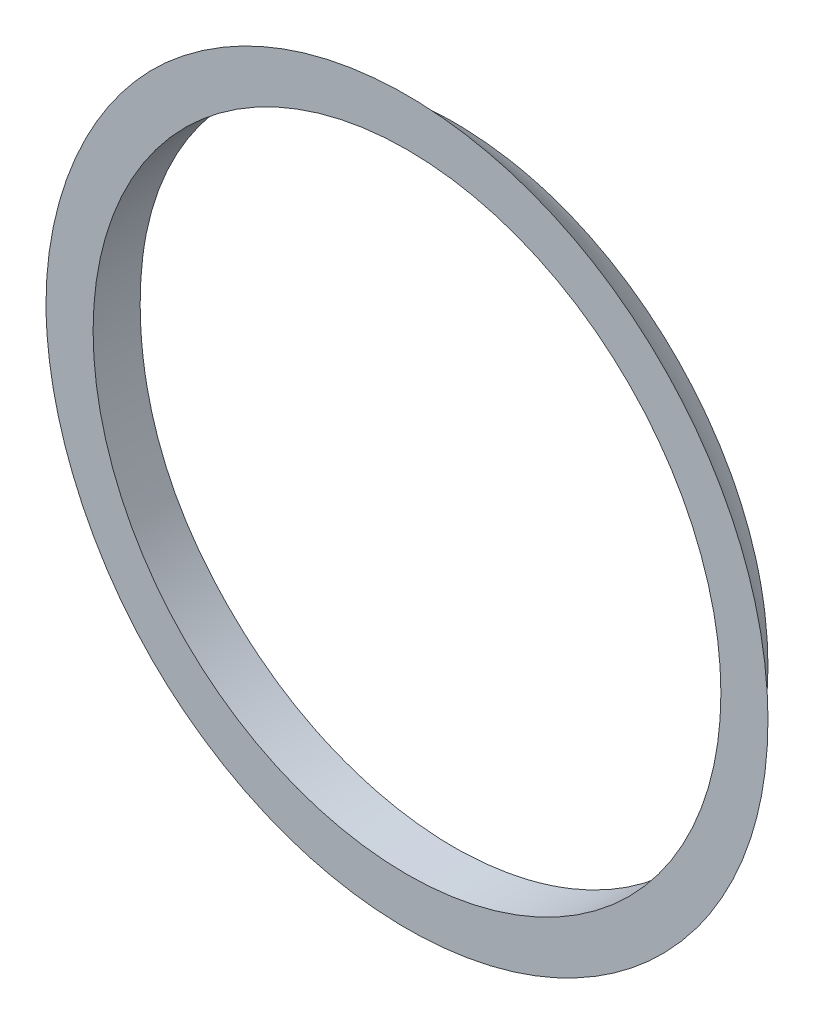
ISO-10303-21;
HEADER;
FILE_DESCRIPTION(('STEP AP214'),'2;1');
FILE_NAME('part.step','',(''),(''),'','','');
FILE_SCHEMA(('AUTOMOTIVE_DESIGN { 1 0 10303 214 1 1 1 1 }'));
ENDSEC;
DATA;
#1=APPLICATION_CONTEXT('core data for automotive mechanical design processes');
#2=APPLICATION_PROTOCOL_DEFINITION('international standard','automotive_design',2000,#1);
#3=PRODUCT_CONTEXT('',#1,'mechanical');
#4=PRODUCT('Part','Part','',(#3));
#5=PRODUCT_RELATED_PRODUCT_CATEGORY('part','',(#4));
#6=PRODUCT_DEFINITION_FORMATION('','',#4);
#7=PRODUCT_DEFINITION_CONTEXT('part definition',#1,'design');
#8=PRODUCT_DEFINITION('design','',#6,#7);
#9=PRODUCT_DEFINITION_SHAPE('','',#8);
#10=(LENGTH_UNIT() NAMED_UNIT(*) SI_UNIT(.MILLI.,.METRE.));
#11=(NAMED_UNIT(*) PLANE_ANGLE_UNIT() SI_UNIT($,.RADIAN.));
#12=(NAMED_UNIT(*) SI_UNIT($,.STERADIAN.) SOLID_ANGLE_UNIT());
#13=UNCERTAINTY_MEASURE_WITH_UNIT(LENGTH_MEASURE(1.E-05),#10,'distance_accuracy_value','');
#14=(GEOMETRIC_REPRESENTATION_CONTEXT(3) GLOBAL_UNCERTAINTY_ASSIGNED_CONTEXT((#13)) GLOBAL_UNIT_ASSIGNED_CONTEXT((#10,
#11,#12)) REPRESENTATION_CONTEXT('',''));
#15=CARTESIAN_POINT('',(0.,0.,0.));
#16=DIRECTION('',(0.,0.,1.));
#17=DIRECTION('',(1.,0.,0.));
#18=AXIS2_PLACEMENT_3D('',#15,#16,#17);
#19=CARTESIAN_POINT('',(614.509309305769,782.325008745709,-184.999999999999));
#20=DIRECTION('',(0.,0.,0.999999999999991));
#21=DIRECTION('',(0.453546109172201,-0.89123281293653,0.));
#22=AXIS2_PLACEMENT_3D('',#19,#20,#21);
#23=PLANE('',#22);
#24=CARTESIAN_POINT('',(695.031944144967,689.142048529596,-184.999999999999));
#25=CARTESIAN_POINT('',(695.031936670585,689.764843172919,-184.999999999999));
#26=CARTESIAN_POINT('',(695.059430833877,690.387519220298,-184.999999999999));
#27=CARTESIAN_POINT('',(695.167107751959,691.628495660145,-184.999999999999));
#28=CARTESIAN_POINT('',(695.247307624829,692.246794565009,-184.999999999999));
#29=CARTESIAN_POINT('',(695.458288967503,693.476007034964,-184.999999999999));
#30=CARTESIAN_POINT('',(695.589179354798,694.086901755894,-184.999999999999));
#31=CARTESIAN_POINT('',(695.89929312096,695.296268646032,-184.999999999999));
#32=CARTESIAN_POINT('',(696.078512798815,695.894741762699,-184.999999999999));
#33=CARTESIAN_POINT('',(696.415342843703,696.877652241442,-184.999999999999));
#34=CARTESIAN_POINT('',(696.560049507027,697.266571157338,-184.999999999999));
#35=CARTESIAN_POINT('',(696.869390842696,698.036423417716,-184.999999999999));
#36=CARTESIAN_POINT('',(697.034025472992,698.417356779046,-184.999999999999));
#37=CARTESIAN_POINT('',(697.382731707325,699.170216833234,-184.999999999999));
#38=CARTESIAN_POINT('',(697.566803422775,699.542143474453,-184.999999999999));
#39=CARTESIAN_POINT('',(697.95373050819,700.275565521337,-184.999999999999));
#40=CARTESIAN_POINT('',(698.156564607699,700.637072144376,-184.999999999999));
#41=CARTESIAN_POINT('',(698.580793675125,701.349033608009,-184.999999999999));
#42=CARTESIAN_POINT('',(698.802188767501,701.699488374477,-184.999999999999));
#43=CARTESIAN_POINT('',(699.263190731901,702.388267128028,-184.999999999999));
#44=CARTESIAN_POINT('',(699.502799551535,702.726589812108,-184.999999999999));
#45=CARTESIAN_POINT('',(700.02007363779,703.416864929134,-184.999999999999));
#46=CARTESIAN_POINT('',(700.299249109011,703.767687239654,-184.999999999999));
#47=CARTESIAN_POINT('',(700.878010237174,704.45213117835,-184.999999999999));
#48=CARTESIAN_POINT('',(701.177595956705,704.785752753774,-184.999999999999));
#49=CARTESIAN_POINT('',(701.641845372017,705.271874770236,-184.999999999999));
#50=CARTESIAN_POINT('',(701.79907289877,705.431529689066,-184.999999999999));
#51=CARTESIAN_POINT('',(702.118392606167,705.745897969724,-184.999999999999));
#52=CARTESIAN_POINT('',(702.280484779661,705.900611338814,-184.999999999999));
#53=CARTESIAN_POINT('',(702.773905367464,706.357324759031,-184.999999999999));
#54=CARTESIAN_POINT('',(703.11226637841,706.651781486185,-184.999999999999));
#55=CARTESIAN_POINT('',(703.806088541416,707.219896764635,-184.999999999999));
#56=CARTESIAN_POINT('',(704.161552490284,707.493551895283,-184.999999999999));
#57=CARTESIAN_POINT('',(704.706209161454,707.888113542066,-184.999999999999));
#58=CARTESIAN_POINT('',(704.889678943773,708.016985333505,-184.999999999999));
#59=CARTESIAN_POINT('',(705.260267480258,708.269451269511,-184.999999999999));
#60=CARTESIAN_POINT('',(705.447387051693,708.393044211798,-184.999999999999));
#61=CARTESIAN_POINT('',(706.168850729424,708.854872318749,-184.999999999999));
#62=CARTESIAN_POINT('',(706.715371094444,709.174396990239,-184.999999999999));
#63=CARTESIAN_POINT('',(707.832621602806,709.767788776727,-184.999999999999));
#64=CARTESIAN_POINT('',(708.403353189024,710.041653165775,-184.999999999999));
#65=CARTESIAN_POINT('',(709.565363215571,710.540998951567,-184.999999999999));
#66=CARTESIAN_POINT('',(710.156633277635,710.76649981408,-184.999999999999));
#67=CARTESIAN_POINT('',(711.35615689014,711.167027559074,-184.999999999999));
#68=CARTESIAN_POINT('',(711.964411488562,711.34205131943,-185.));
#69=CARTESIAN_POINT('',(712.891709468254,711.567245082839,-184.999999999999));
#70=CARTESIAN_POINT('',(713.20623074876,711.636540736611,-184.999999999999));
#71=CARTESIAN_POINT('',(713.837939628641,711.761770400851,-184.999999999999));
#72=CARTESIAN_POINT('',(714.155127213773,711.817704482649,-184.999999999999));
#73=CARTESIAN_POINT('',(714.791552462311,711.916344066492,-184.999999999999));
#74=CARTESIAN_POINT('',(715.110790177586,711.959049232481,-184.999999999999));
#75=CARTESIAN_POINT('',(715.750759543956,712.031243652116,-184.999999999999));
#76=CARTESIAN_POINT('',(716.071491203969,712.060732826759,-184.999999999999));
#77=CARTESIAN_POINT('',(716.714014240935,712.106436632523,-184.999999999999));
#78=CARTESIAN_POINT('',(717.035805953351,712.12264655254,-184.999999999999));
#79=CARTESIAN_POINT('',(717.679783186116,712.141568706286,-184.999999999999));
#80=CARTESIAN_POINT('',(718.001968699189,712.144281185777,-184.999999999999));
#81=CARTESIAN_POINT('',(718.646168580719,712.136098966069,-184.999999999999));
#82=CARTESIAN_POINT('',(718.968182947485,712.12520413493,-184.999999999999));
#83=CARTESIAN_POINT('',(719.611487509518,712.090064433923,-184.999999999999));
#84=CARTESIAN_POINT('',(719.932777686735,712.06581923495,-184.999999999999));
#85=CARTESIAN_POINT('',(720.577211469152,712.003769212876,-184.999999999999));
#86=CARTESIAN_POINT('',(720.900342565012,711.965834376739,-184.999999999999));
#87=CARTESIAN_POINT('',(721.544729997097,711.876472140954,-184.999999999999));
#88=CARTESIAN_POINT('',(721.865986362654,711.825044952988,-184.999999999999));
#89=CARTESIAN_POINT('',(722.506010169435,711.708585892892,-184.999999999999));
#90=CARTESIAN_POINT('',(722.824777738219,711.643554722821,-184.999999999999));
#91=CARTESIAN_POINT('',(723.45921955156,711.49981106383,-184.999999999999));
#92=CARTESIAN_POINT('',(723.774893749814,711.421098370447,-184.999999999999));
#93=CARTESIAN_POINT('',(724.402445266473,711.250147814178,-184.999999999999));
#94=CARTESIAN_POINT('',(724.714323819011,711.157914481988,-184.999999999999));
#95=CARTESIAN_POINT('',(725.333814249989,710.960086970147,-184.999999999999));
#96=CARTESIAN_POINT('',(725.641426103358,710.854492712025,-184.999999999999));
#97=CARTESIAN_POINT('',(726.25181854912,710.630210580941,-184.999999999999));
#98=CARTESIAN_POINT('',(726.5545994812,710.511523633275,-184.999999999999));
#99=CARTESIAN_POINT('',(727.154901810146,710.261374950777,-184.999999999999));
#100=CARTESIAN_POINT('',(727.452421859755,710.129909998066,-184.999999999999));
#101=CARTESIAN_POINT('',(728.329216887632,709.720047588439,-184.999999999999));
#102=CARTESIAN_POINT('',(728.900118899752,709.423457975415,-184.999999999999));
#103=CARTESIAN_POINT('',(730.015068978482,708.783638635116,-184.999999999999));
#104=CARTESIAN_POINT('',(730.559116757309,708.440408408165,-184.999999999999));
#105=CARTESIAN_POINT('',(731.616761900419,707.709505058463,-184.999999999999));
#106=CARTESIAN_POINT('',(732.130349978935,707.3218184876,-184.999999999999));
#107=CARTESIAN_POINT('',(733.123450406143,706.504995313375,-184.999999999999));
#108=CARTESIAN_POINT('',(733.602961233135,706.07585686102,-184.999999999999));
#109=CARTESIAN_POINT('',(734.528859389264,705.175219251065,-184.999999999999));
#110=CARTESIAN_POINT('',(734.974909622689,704.703373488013,-184.999999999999));
#111=CARTESIAN_POINT('',(735.825825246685,703.723912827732,-184.999999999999));
#112=CARTESIAN_POINT('',(736.230691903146,703.216299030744,-184.999999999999));
#113=CARTESIAN_POINT('',(736.996034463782,702.168891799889,-184.999999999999));
#114=CARTESIAN_POINT('',(737.356523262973,701.629107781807,-184.999999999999));
#115=CARTESIAN_POINT('',(738.030720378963,700.520937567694,-184.999999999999));
#116=CARTESIAN_POINT('',(738.34442630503,699.952549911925,-184.999999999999));
#117=CARTESIAN_POINT('',(738.778309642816,699.081421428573,-184.999999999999));
#118=CARTESIAN_POINT('',(738.9169174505,698.787720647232,-184.999999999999));
#119=CARTESIAN_POINT('',(739.181591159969,698.194702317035,-184.999999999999));
#120=CARTESIAN_POINT('',(739.30765727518,697.895384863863,-184.999999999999));
#121=CARTESIAN_POINT('',(739.54691555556,697.291675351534,-184.999999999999));
#122=CARTESIAN_POINT('',(739.660108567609,696.98728362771,-184.999999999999));
#123=CARTESIAN_POINT('',(739.873317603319,696.3739164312,-184.999999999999));
#124=CARTESIAN_POINT('',(739.973333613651,696.064940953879,-184.999999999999));
#125=CARTESIAN_POINT('',(740.159973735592,695.442912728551,-184.999999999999));
#126=CARTESIAN_POINT('',(740.24659550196,695.1298592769,-184.999999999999));
#127=CARTESIAN_POINT('',(740.406279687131,694.500274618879,-184.999999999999));
#128=CARTESIAN_POINT('',(740.479340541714,694.183743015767,-184.999999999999));
#129=CARTESIAN_POINT('',(740.61181839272,693.547821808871,-184.999999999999));
#130=CARTESIAN_POINT('',(740.671234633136,693.228432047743,-184.999999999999));
#131=CARTESIAN_POINT('',(740.776560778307,692.587471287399,-184.999999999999));
#132=CARTESIAN_POINT('',(740.82247212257,692.265900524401,-184.999999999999));
#133=CARTESIAN_POINT('',(740.900386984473,691.624902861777,-184.999999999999));
#134=CARTESIAN_POINT('',(740.93254713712,691.305494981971,-184.999999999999));
#135=CARTESIAN_POINT('',(740.983683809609,690.665630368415,-184.999999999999));
#136=CARTESIAN_POINT('',(741.002660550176,690.345173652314,-184.999999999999));
#137=CARTESIAN_POINT('',(741.027280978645,689.70374869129,-184.999999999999));
#138=CARTESIAN_POINT('',(741.032924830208,689.382780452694,-184.999999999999));
#139=CARTESIAN_POINT('',(741.030681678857,688.740892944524,-184.999999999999));
#140=CARTESIAN_POINT('',(741.02279463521,688.419973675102,-184.999999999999));
#141=CARTESIAN_POINT('',(740.993731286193,687.778783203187,-184.999999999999));
#142=CARTESIAN_POINT('',(740.97255709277,687.458511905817,-184.999999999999));
#143=CARTESIAN_POINT('',(740.917044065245,686.819140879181,-184.999999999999));
#144=CARTESIAN_POINT('',(740.882705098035,686.500041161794,-184.999999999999));
#145=CARTESIAN_POINT('',(740.759997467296,685.545245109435,-184.999999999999));
#146=CARTESIAN_POINT('',(740.651931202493,684.9119008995,-185.));
#147=CARTESIAN_POINT('',(740.44886098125,683.965692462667,-184.999999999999));
#148=CARTESIAN_POINT('',(740.373581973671,683.64843807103,-184.999999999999));
#149=CARTESIAN_POINT('',(740.209371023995,683.017490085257,-184.999999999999));
#150=CARTESIAN_POINT('',(740.120440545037,682.703796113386,-184.999999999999));
#151=CARTESIAN_POINT('',(739.929086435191,682.080525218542,-184.999999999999));
#152=CARTESIAN_POINT('',(739.826661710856,681.770948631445,-184.999999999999));
#153=CARTESIAN_POINT('',(739.608575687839,681.15651626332,-184.999999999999));
#154=CARTESIAN_POINT('',(739.492914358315,680.851660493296,-184.999999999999));
#155=CARTESIAN_POINT('',(739.126579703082,679.944938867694,-184.999999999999));
#156=CARTESIAN_POINT('',(738.856511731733,679.350775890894,-184.999999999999));
#157=CARTESIAN_POINT('',(738.2670350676,678.187563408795,-184.999999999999));
#158=CARTESIAN_POINT('',(737.947626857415,677.618513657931,-184.999999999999));
#159=CARTESIAN_POINT('',(737.26704154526,676.518240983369,-184.999999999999));
#160=CARTESIAN_POINT('',(736.90659713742,675.986565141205,-184.999999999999));
#161=CARTESIAN_POINT('',(736.142612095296,674.955155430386,-184.999999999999));
#162=CARTESIAN_POINT('',(735.739071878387,674.455421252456,-184.999999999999));
#163=CARTESIAN_POINT('',(734.891852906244,673.491120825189,-184.999999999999));
#164=CARTESIAN_POINT('',(734.448169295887,673.026558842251,-184.999999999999));
#165=CARTESIAN_POINT('',(733.523832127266,672.135803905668,-184.999999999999));
#166=CARTESIAN_POINT('',(733.043178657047,671.709610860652,-184.999999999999));
#167=CARTESIAN_POINT('',(732.041593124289,670.893411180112,-184.999999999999));
#168=CARTESIAN_POINT('',(731.520218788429,670.503946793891,-184.999999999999));
#169=CARTESIAN_POINT('',(730.44637134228,669.770549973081,-184.999999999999));
#170=CARTESIAN_POINT('',(729.893896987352,669.426619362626,-184.999999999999));
#171=CARTESIAN_POINT('',(728.761902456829,668.78674036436,-184.999999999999));
#172=CARTESIAN_POINT('',(728.182388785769,668.490780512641,-184.999999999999));
#173=CARTESIAN_POINT('',(727.296082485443,668.084481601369,-184.999999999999));
#174=CARTESIAN_POINT('',(726.997783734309,667.955313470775,-184.999999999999));
#175=CARTESIAN_POINT('',(726.395935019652,667.70976737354,-184.999999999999));
#176=CARTESIAN_POINT('',(726.092384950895,667.59338966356,-184.999999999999));
#177=CARTESIAN_POINT('',(725.482046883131,667.374306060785,-184.999999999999));
#178=CARTESIAN_POINT('',(725.17528154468,667.271536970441,-184.999999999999));
#179=CARTESIAN_POINT('',(724.55765168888,667.079264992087,-184.999999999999));
#180=CARTESIAN_POINT('',(724.246787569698,666.989760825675,-184.999999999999));
#181=CARTESIAN_POINT('',(723.621477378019,666.824168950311,-184.999999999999));
#182=CARTESIAN_POINT('',(723.307030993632,666.748082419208,-184.999999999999));
#183=CARTESIAN_POINT('',(722.675169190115,666.60944517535,-184.999999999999));
#184=CARTESIAN_POINT('',(722.357753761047,666.546894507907,-184.999999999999));
#185=CARTESIAN_POINT('',(721.720518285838,666.435211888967,-184.999999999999));
#186=CARTESIAN_POINT('',(721.400697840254,666.386082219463,-184.999999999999));
#187=CARTESIAN_POINT('',(720.759290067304,666.301166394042,-184.999999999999));
#188=CARTESIAN_POINT('',(720.437702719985,666.265380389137,-184.999999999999));
#189=CARTESIAN_POINT('',(719.793316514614,666.207188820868,-184.999999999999));
#190=CARTESIAN_POINT('',(719.470517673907,666.184783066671,-184.999999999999));
#191=CARTESIAN_POINT('',(718.824299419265,666.153462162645,-184.999999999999));
#192=CARTESIAN_POINT('',(718.500880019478,666.144546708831,-184.999999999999));
#193=CARTESIAN_POINT('',(717.532535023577,666.138442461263,-184.999999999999));
#194=CARTESIAN_POINT('',(716.887317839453,666.161694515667,-184.999999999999));
#195=CARTESIAN_POINT('',(715.922857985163,666.236467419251,-184.999999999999));
#196=CARTESIAN_POINT('',(715.601890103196,666.268047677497,-184.999999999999));
#197=CARTESIAN_POINT('',(714.961505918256,666.344457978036,-184.999999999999));
#198=CARTESIAN_POINT('',(714.642089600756,666.38928789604,-184.999999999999));
#199=CARTESIAN_POINT('',(714.005402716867,666.492229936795,-184.999999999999));
#200=CARTESIAN_POINT('',(713.688132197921,666.550342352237,-184.999999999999));
#201=CARTESIAN_POINT('',(713.05633872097,666.67999391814,-184.999999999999));
#202=CARTESIAN_POINT('',(712.741815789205,666.751533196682,-184.999999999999));
#203=CARTESIAN_POINT('',(712.116160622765,666.90799396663,-184.999999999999));
#204=CARTESIAN_POINT('',(711.805027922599,666.992913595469,-184.999999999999));
#205=CARTESIAN_POINT('',(711.186687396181,667.176017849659,-184.999999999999));
#206=CARTESIAN_POINT('',(710.87947969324,667.274202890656,-184.999999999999));
#207=CARTESIAN_POINT('',(710.1675092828,667.518687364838,-184.999999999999));
#208=CARTESIAN_POINT('',(709.764489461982,667.670094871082,-184.999999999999));
#209=CARTESIAN_POINT('',(708.967659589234,667.995528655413,-184.999999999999));
#210=CARTESIAN_POINT('',(708.573850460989,668.169557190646,-184.999999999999));
#211=CARTESIAN_POINT('',(707.796563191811,668.539412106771,-184.999999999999));
#212=CARTESIAN_POINT('',(707.413086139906,668.735240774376,-184.999999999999));
#213=CARTESIAN_POINT('',(706.657689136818,669.147798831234,-184.999999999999));
#214=CARTESIAN_POINT('',(706.285765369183,669.364521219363,-184.999999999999));
#215=CARTESIAN_POINT('',(705.73729489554,669.704670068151,-184.999999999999));
#216=CARTESIAN_POINT('',(705.556037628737,669.820565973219,-184.999999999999));
#217=CARTESIAN_POINT('',(705.196764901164,670.05727783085,-184.999999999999));
#218=CARTESIAN_POINT('',(705.01874944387,670.178093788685,-184.999999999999));
#219=CARTESIAN_POINT('',(704.489842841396,670.54785367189,-184.999999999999));
#220=CARTESIAN_POINT('',(704.1440396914,670.80414169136,-184.999999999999));
#221=CARTESIAN_POINT('',(703.465378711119,671.337807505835,-184.999999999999));
#222=CARTESIAN_POINT('',(703.132622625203,671.61531458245,-184.999999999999));
#223=CARTESIAN_POINT('',(702.48399389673,672.189417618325,-184.999999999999));
#224=CARTESIAN_POINT('',(702.168120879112,672.486013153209,-184.999999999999));
#225=CARTESIAN_POINT('',(701.554716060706,673.097567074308,-184.999999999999));
#226=CARTESIAN_POINT('',(701.257183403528,673.412524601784,-184.999999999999));
#227=CARTESIAN_POINT('',(700.680908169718,674.05930188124,-184.999999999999));
#228=CARTESIAN_POINT('',(700.402170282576,674.391125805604,-184.999999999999));
#229=CARTESIAN_POINT('',(699.863943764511,675.070091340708,-184.999999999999));
#230=CARTESIAN_POINT('',(699.604457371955,675.417234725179,-184.999999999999));
#231=CARTESIAN_POINT('',(699.105192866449,676.12538864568,-184.999999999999));
#232=CARTESIAN_POINT('',(698.865415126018,676.486399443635,-184.999999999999));
#233=CARTESIAN_POINT('',(698.300099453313,677.390282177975,-184.999999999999));
#234=CARTESIAN_POINT('',(697.985937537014,677.940321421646,-184.999999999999));
#235=CARTESIAN_POINT('',(697.401975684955,679.063374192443,-184.999999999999));
#236=CARTESIAN_POINT('',(697.132174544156,679.636387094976,-184.999999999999));
#237=CARTESIAN_POINT('',(696.638620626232,680.801607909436,-184.999999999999));
#238=CARTESIAN_POINT('',(696.414844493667,681.393805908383,-184.999999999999));
#239=CARTESIAN_POINT('',(696.015107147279,682.593947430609,-184.999999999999));
#240=CARTESIAN_POINT('',(695.83913665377,683.201887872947,-184.999999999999));
#241=CARTESIAN_POINT('',(695.473903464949,684.686917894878,-184.999999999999));
#242=CARTESIAN_POINT('',(695.30980196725,685.570341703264,-184.999999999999));
#243=CARTESIAN_POINT('',(695.08887891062,687.349950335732,-184.999999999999));
#244=CARTESIAN_POINT('',(695.031954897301,688.246122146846,-185.));
#245=CARTESIAN_POINT('',(695.031944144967,689.142048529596,-184.999999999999));
#246=B_SPLINE_CURVE_WITH_KNOTS('',3,(#24,#25,#26,#27,#28,#29,#30,#31,#32,#33,#34,#35,#36,#37,
#38,#39,#40,#41,#42,#43,#44,#45,#46,#47,#48,#49,#50,#51,#52,#53,#54,#55,#56,#57,#58,#59,#60,#61,
#62,#63,#64,#65,#66,#67,#68,#69,#70,#71,#72,#73,#74,#75,#76,#77,#78,#79,#80,#81,#82,#83,#84,#85,
#86,#87,#88,#89,#90,#91,#92,#93,#94,#95,#96,#97,#98,#99,#100,#101,#102,#103,#104,#105,#106,#107,
#108,#109,#110,#111,#112,#113,#114,#115,#116,#117,#118,#119,#120,#121,#122,#123,#124,#125,#126,
#127,#128,#129,#130,#131,#132,#133,#134,#135,#136,#137,#138,#139,#140,#141,#142,#143,#144,#145,
#146,#147,#148,#149,#150,#151,#152,#153,#154,#155,#156,#157,#158,#159,#160,#161,#162,#163,#164,
#165,#166,#167,#168,#169,#170,#171,#172,#173,#174,#175,#176,#177,#178,#179,#180,#181,#182,#183,
#184,#185,#186,#187,#188,#189,#190,#191,#192,#193,#194,#195,#196,#197,#198,#199,#200,#201,#202,
#203,#204,#205,#206,#207,#208,#209,#210,#211,#212,#213,#214,#215,#216,#217,#218,#219,#220,#221,
#222,#223,#224,#225,#226,#227,#228,#229,#230,#231,#232,#233,#234,#235,#236,#237,#238,#239,#240,
#241,#242,#243,#244,#245),.UNSPECIFIED.,.T.,.F.,(4,2,2,2,2,2,2,2,2,2,2,2,2,2,2,2,2,2,2,2,2,2,2,
2,2,2,2,2,2,2,2,2,2,2,2,2,2,2,2,2,2,2,2,2,2,2,2,2,2,2,2,2,2,2,2,2,2,2,2,2,2,2,2,2,2,2,2,2,2,2,2,
2,2,2,2,2,2,2,2,2,2,2,2,2,2,2,2,2,2,2,2,2,2,2,2,2,2,2,2,2,2,2,2,2,2,2,2,2,2,2,4),(0.,
1.86762920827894,3.7358652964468,5.60813809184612,7.48026755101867,8.72466558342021,
9.96906099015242,11.2134635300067,12.4564722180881,13.6994892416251,14.9426393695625,
16.2869180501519,17.6312008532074,18.3033361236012,18.9754704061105,20.3202221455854,
21.6651945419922,22.3377335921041,23.0104250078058,24.9073292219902,26.8043466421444,
28.7005990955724,30.5969688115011,31.5629220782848,32.5288701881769,33.494842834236,
34.4608212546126,35.4271422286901,36.3934456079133,37.3597583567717,38.326094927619,
39.301861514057,40.2776127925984,41.2533137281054,42.2290292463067,43.2044185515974,
44.1798135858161,45.1551397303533,46.1307121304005,48.0582973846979,49.985903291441,
51.9140938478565,53.842370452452,55.7880081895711,57.7335861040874,59.6785973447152,
61.6237079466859,62.5977653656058,63.57180620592,64.5457829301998,65.5197606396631,
66.4939086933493,67.4681690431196,68.4424833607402,69.4166937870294,70.379490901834,
71.3422718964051,72.3050410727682,73.2678131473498,74.2304322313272,75.1930610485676,
77.117866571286,78.0958194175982,79.073667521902,80.0515949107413,81.0295245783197,
82.9849371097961,84.9403305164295,86.8650925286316,88.789835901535,90.7148123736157,
92.6397842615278,94.5897726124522,96.5398390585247,98.4894387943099,99.4643913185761,
100.439363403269,101.409635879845,102.379814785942,103.350078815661,104.320346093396,
105.290778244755,106.261221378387,107.231650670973,108.202058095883,110.136251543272,
111.103604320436,112.070948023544,113.038313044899,114.005687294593,114.97292700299,
115.940197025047,117.231032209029,118.521996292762,119.813095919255,121.1037644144,
121.749120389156,122.394477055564,123.685007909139,124.984147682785,126.283258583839,
127.582308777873,128.881681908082,130.18120588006,131.480754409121,133.378949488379,
135.277092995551,137.174270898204,139.071080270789,141.76034577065,144.447039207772),.UNSPECIFIED.);
#247=CARTESIAN_POINT('',(695.031944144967,689.142048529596,-184.999999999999));
#248=VERTEX_POINT('',#247);
#249=EDGE_CURVE('E61',#248,#248,#246,.T.);
#250=ORIENTED_EDGE('',*,*,#249,.F.);
#251=EDGE_LOOP('',(#250));
#252=FACE_BOUND('',#251,.T.);
#253=CARTESIAN_POINT('',(718.031944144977,689.142048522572,-184.999999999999));
#254=DIRECTION('',(0.,0.,0.999999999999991));
#255=DIRECTION('',(1.,0.,0.));
#256=AXIS2_PLACEMENT_3D('',#253,#254,#255);
#257=CIRCLE('',#256,20.);
#258=CARTESIAN_POINT('',(738.031944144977,689.142048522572,-184.999999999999));
#259=VERTEX_POINT('',#258);
#260=EDGE_CURVE('E71',#259,#259,#257,.T.);
#261=ORIENTED_EDGE('',*,*,#260,.F.);
#262=EDGE_LOOP('',(#261));
#263=FACE_BOUND('',#262,.T.);
#264=ADVANCED_FACE('F54',(#252,#263),#23,.T.);
#265=CARTESIAN_POINT('',(718.031944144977,689.142048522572,-152.499999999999));
#266=DIRECTION('',(0.,0.,-0.999999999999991));
#267=DIRECTION('',(-0.453546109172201,0.89123281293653,0.));
#268=AXIS2_PLACEMENT_3D('',#265,#266,#267);
#269=CYLINDRICAL_SURFACE('',#268,20.);
#270=ORIENTED_EDGE('',*,*,#260,.T.);
#271=EDGE_LOOP('',(#270));
#272=FACE_BOUND('',#271,.T.);
#273=CARTESIAN_POINT('',(698.031944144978,689.142048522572,-187.999999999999));
#274=CARTESIAN_POINT('',(698.031947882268,688.581115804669,-188.000001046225));
#275=CARTESIAN_POINT('',(698.055563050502,688.020078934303,-187.996684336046));
#276=CARTESIAN_POINT('',(698.149872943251,686.901908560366,-187.986761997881));
#277=CARTESIAN_POINT('',(698.220580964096,686.344776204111,-187.980155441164));
#278=CARTESIAN_POINT('',(698.408680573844,685.237812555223,-187.966517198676));
#279=CARTESIAN_POINT('',(698.526124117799,684.687990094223,-187.959485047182));
#280=CARTESIAN_POINT('',(698.806884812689,683.600158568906,-187.947181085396));
#281=CARTESIAN_POINT('',(698.970198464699,683.062148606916,-187.941909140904));
#282=CARTESIAN_POINT('',(699.279643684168,682.178451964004,-187.935716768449));
#283=CARTESIAN_POINT('',(699.413388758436,681.828378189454,-187.933931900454));
#284=CARTESIAN_POINT('',(699.700341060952,681.136260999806,-187.931934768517));
#285=CARTESIAN_POINT('',(699.853548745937,680.794217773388,-187.931722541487));
#286=CARTESIAN_POINT('',(700.178929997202,680.119285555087,-187.932906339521));
#287=CARTESIAN_POINT('',(700.351103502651,679.786396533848,-187.934302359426));
#288=CARTESIAN_POINT('',(700.713832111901,679.130890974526,-187.938559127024));
#289=CARTESIAN_POINT('',(700.904383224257,678.808272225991,-187.941419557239));
#290=CARTESIAN_POINT('',(701.303294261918,678.17425234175,-187.948283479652));
#291=CARTESIAN_POINT('',(701.511654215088,677.862851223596,-187.952286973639));
#292=CARTESIAN_POINT('',(701.945526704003,677.252244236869,-187.960928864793));
#293=CARTESIAN_POINT('',(702.171039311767,676.953038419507,-187.965567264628));
#294=CARTESIAN_POINT('',(702.638316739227,676.368001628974,-187.974774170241));
#295=CARTESIAN_POINT('',(702.880068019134,676.082159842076,-187.979342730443));
#296=CARTESIAN_POINT('',(703.379232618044,675.524483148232,-187.987525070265));
#297=CARTESIAN_POINT('',(703.636645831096,675.252648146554,-187.991138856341));
#298=CARTESIAN_POINT('',(704.166327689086,674.723840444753,-187.996329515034));
#299=CARTESIAN_POINT('',(704.438596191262,674.466867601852,-187.997906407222));
#300=CARTESIAN_POINT('',(704.997126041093,673.96859844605,-187.999570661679));
#301=CARTESIAN_POINT('',(705.283387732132,673.72730251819,-187.999657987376));
#302=CARTESIAN_POINT('',(705.869018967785,673.261138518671,-187.999146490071));
#303=CARTESIAN_POINT('',(706.16838867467,673.036270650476,-187.998547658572));
#304=CARTESIAN_POINT('',(706.626515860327,672.711855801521,-187.997900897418));
#305=CARTESIAN_POINT('',(706.780743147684,672.60586150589,-187.997727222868));
#306=CARTESIAN_POINT('',(707.092113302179,672.398239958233,-187.99758291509));
#307=CARTESIAN_POINT('',(707.249256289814,672.296612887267,-187.997612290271));
#308=CARTESIAN_POINT('',(707.883771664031,671.898786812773,-187.99807666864));
#309=CARTESIAN_POINT('',(708.372459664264,671.620344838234,-187.999205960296));
#310=CARTESIAN_POINT('',(709.371522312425,671.1056162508,-188.002113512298));
#311=CARTESIAN_POINT('',(709.881896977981,670.86932967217,-188.003891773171));
#312=CARTESIAN_POINT('',(710.660905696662,670.547781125,-188.006010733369));
#313=CARTESIAN_POINT('',(710.92284646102,670.446068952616,-188.006625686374));
#314=CARTESIAN_POINT('',(711.450780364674,670.25376621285,-188.007530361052));
#315=CARTESIAN_POINT('',(711.716773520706,670.163175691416,-188.007820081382));
#316=CARTESIAN_POINT('',(712.520095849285,669.90835287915,-188.008085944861));
#317=CARTESIAN_POINT('',(713.062884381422,669.761021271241,-188.007459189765));
#318=CARTESIAN_POINT('',(714.159266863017,669.512517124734,-188.005003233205));
#319=CARTESIAN_POINT('',(714.712867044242,669.411372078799,-188.003173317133));
#320=CARTESIAN_POINT('',(715.548048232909,669.294898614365,-188.001275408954));
#321=CARTESIAN_POINT('',(715.827270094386,669.261946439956,-188.000783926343));
#322=CARTESIAN_POINT('',(716.386872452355,669.207838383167,-188.000125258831));
#323=CARTESIAN_POINT('',(716.667252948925,669.186682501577,-187.999958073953));
#324=CARTESIAN_POINT('',(717.228651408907,669.156209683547,-187.999869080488));
#325=CARTESIAN_POINT('',(717.509669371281,669.14689272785,-187.999947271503));
#326=CARTESIAN_POINT('',(718.07184953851,669.14011292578,-187.999998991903));
#327=CARTESIAN_POINT('',(718.353011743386,669.142650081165,-187.999972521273));
#328=CARTESIAN_POINT('',(718.914979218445,669.159574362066,-187.99996992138));
#329=CARTESIAN_POINT('',(719.195784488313,669.173961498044,-187.999993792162));
#330=CARTESIAN_POINT('',(719.756538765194,669.214560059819,-188.00033290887));
#331=CARTESIAN_POINT('',(720.036487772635,669.240771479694,-188.00064815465));
#332=CARTESIAN_POINT('',(720.595042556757,669.304973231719,-188.001581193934));
#333=CARTESIAN_POINT('',(720.873648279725,669.342964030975,-188.002198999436));
#334=CARTESIAN_POINT('',(721.429010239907,669.430656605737,-188.003601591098));
#335=CARTESIAN_POINT('',(721.705766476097,669.480358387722,-188.004386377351));
#336=CARTESIAN_POINT('',(722.256937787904,669.59138465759,-188.005759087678));
#337=CARTESIAN_POINT('',(722.531352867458,669.652709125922,-188.006347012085));
#338=CARTESIAN_POINT('',(723.077354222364,669.786871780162,-188.007186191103));
#339=CARTESIAN_POINT('',(723.348940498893,669.859709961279,-188.007437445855));
#340=CARTESIAN_POINT('',(723.888801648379,670.016770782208,-188.007588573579));
#341=CARTESIAN_POINT('',(724.157076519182,670.100993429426,-188.007488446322));
#342=CARTESIAN_POINT('',(724.689835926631,670.280672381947,-188.006985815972));
#343=CARTESIAN_POINT('',(724.954320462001,670.376128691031,-188.006583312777));
#344=CARTESIAN_POINT('',(725.479034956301,670.578108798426,-188.005615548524));
#345=CARTESIAN_POINT('',(725.739264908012,670.684632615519,-188.00505028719));
#346=CARTESIAN_POINT('',(726.254986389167,670.908545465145,-188.003920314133));
#347=CARTESIAN_POINT('',(726.510477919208,671.025934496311,-188.003355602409));
#348=CARTESIAN_POINT('',(727.269171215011,671.394104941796,-188.001695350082));
#349=CARTESIAN_POINT('',(727.764706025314,671.660933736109,-188.000633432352));
#350=CARTESIAN_POINT('',(728.731468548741,672.235350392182,-187.998634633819));
#351=CARTESIAN_POINT('',(729.202696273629,672.542938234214,-187.997697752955));
#352=CARTESIAN_POINT('',(730.117584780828,673.196724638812,-187.995925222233));
#353=CARTESIAN_POINT('',(730.561245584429,673.542923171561,-187.995089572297));
#354=CARTESIAN_POINT('',(731.417823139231,674.271460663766,-187.993922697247));
#355=CARTESIAN_POINT('',(731.830739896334,674.653799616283,-187.993591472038));
#356=CARTESIAN_POINT('',(732.622916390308,675.451917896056,-187.993650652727));
#357=CARTESIAN_POINT('',(733.002174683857,675.867698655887,-187.994041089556));
#358=CARTESIAN_POINT('',(733.724318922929,676.729735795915,-187.995292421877));
#359=CARTESIAN_POINT('',(734.067204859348,677.17599218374,-187.996153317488));
#360=CARTESIAN_POINT('',(734.714157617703,678.095784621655,-187.997952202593));
#361=CARTESIAN_POINT('',(735.018224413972,678.569320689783,-187.998890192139));
#362=CARTESIAN_POINT('',(735.585414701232,679.540396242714,-188.00090491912));
#363=CARTESIAN_POINT('',(735.848538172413,680.037935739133,-188.001981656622));
#364=CARTESIAN_POINT('',(736.211034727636,680.79939928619,-188.003655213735));
#365=CARTESIAN_POINT('',(736.326513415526,681.05577614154,-188.004222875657));
#366=CARTESIAN_POINT('',(736.546569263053,681.573187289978,-188.005344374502));
#367=CARTESIAN_POINT('',(736.651146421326,681.834221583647,-188.005898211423));
#368=CARTESIAN_POINT('',(736.849200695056,682.360462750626,-188.006808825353));
#369=CARTESIAN_POINT('',(736.942677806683,682.625669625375,-188.007165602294));
#370=CARTESIAN_POINT('',(737.118368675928,683.159788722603,-188.007561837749));
#371=CARTESIAN_POINT('',(737.200582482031,683.428700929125,-188.007601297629));
#372=CARTESIAN_POINT('',(737.353600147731,683.969752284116,-188.007327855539));
#373=CARTESIAN_POINT('',(737.424403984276,684.241891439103,-188.007014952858));
#374=CARTESIAN_POINT('',(737.554475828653,684.78891242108,-188.006054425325));
#375=CARTESIAN_POINT('',(737.613743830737,685.063794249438,-188.005406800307));
#376=CARTESIAN_POINT('',(737.720638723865,685.6158120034,-188.003976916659));
#377=CARTESIAN_POINT('',(737.768265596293,685.89294793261,-188.003194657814));
#378=CARTESIAN_POINT('',(737.85179355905,686.448982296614,-188.001838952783));
#379=CARTESIAN_POINT('',(737.887694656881,686.727880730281,-188.001265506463));
#380=CARTESIAN_POINT('',(737.947705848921,687.286928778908,-188.000434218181));
#381=CARTESIAN_POINT('',(737.971816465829,687.567078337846,-188.000176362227));
#382=CARTESIAN_POINT('',(738.008206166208,688.128154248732,-187.999925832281));
#383=CARTESIAN_POINT('',(738.02048524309,688.409080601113,-187.999933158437));
#384=CARTESIAN_POINT('',(738.030013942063,688.830653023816,-187.999977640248));
#385=CARTESIAN_POINT('',(738.031708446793,688.971211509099,-187.999998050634));
#386=CARTESIAN_POINT('',(738.032134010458,689.252332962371,-188.000001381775));
#387=CARTESIAN_POINT('',(738.030865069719,689.392895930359,-187.999984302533));
#388=CARTESIAN_POINT('',(738.022612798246,689.814494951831,-187.999939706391));
#389=CARTESIAN_POINT('',(738.011184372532,690.095456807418,-187.999918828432));
#390=CARTESIAN_POINT('',(737.976493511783,690.656640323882,-188.000133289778));
#391=CARTESIAN_POINT('',(737.953231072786,690.936861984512,-188.000368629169));
#392=CARTESIAN_POINT('',(737.894914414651,691.496075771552,-188.001156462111));
#393=CARTESIAN_POINT('',(737.8598601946,691.775067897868,-188.001708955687));
#394=CARTESIAN_POINT('',(737.778019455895,692.33133176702,-188.003036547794));
#395=CARTESIAN_POINT('',(737.73123294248,692.608603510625,-188.003811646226));
#396=CARTESIAN_POINT('',(737.626021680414,693.160903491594,-188.005257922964));
#397=CARTESIAN_POINT('',(737.567596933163,693.435931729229,-188.005929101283));
#398=CARTESIAN_POINT('',(737.374987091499,694.256978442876,-188.007430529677));
#399=CARTESIAN_POINT('',(737.223448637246,694.799079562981,-188.007749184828));
#400=CARTESIAN_POINT('',(736.962372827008,695.600997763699,-188.007231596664));
#401=CARTESIAN_POINT('',(736.86970731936,695.866460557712,-188.006893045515));
#402=CARTESIAN_POINT('',(736.673270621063,696.393252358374,-188.006007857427));
#403=CARTESIAN_POINT('',(736.56949942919,696.654581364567,-188.005461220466));
#404=CARTESIAN_POINT('',(736.241797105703,697.431630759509,-188.003791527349));
#405=CARTESIAN_POINT('',(736.001438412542,697.94053269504,-188.002638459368));
#406=CARTESIAN_POINT('',(735.478736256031,698.936215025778,-188.000496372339));
#407=CARTESIAN_POINT('',(735.196392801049,699.422995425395,-187.999507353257));
#408=CARTESIAN_POINT('',(734.591704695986,700.371046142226,-187.997584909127));
#409=CARTESIAN_POINT('',(734.269361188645,700.832317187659,-187.996651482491));
#410=CARTESIAN_POINT('',(733.586966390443,701.72606262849,-187.995027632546));
#411=CARTESIAN_POINT('',(733.226915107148,702.158537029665,-187.994337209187));
#412=CARTESIAN_POINT('',(732.471661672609,702.991621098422,-187.99358624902));
#413=CARTESIAN_POINT('',(732.07645953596,703.392230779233,-187.99352571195));
#414=CARTESIAN_POINT('',(731.253714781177,704.158735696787,-187.994075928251));
#415=CARTESIAN_POINT('',(730.82617215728,704.524630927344,-187.994686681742));
#416=CARTESIAN_POINT('',(729.941768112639,705.219119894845,-187.996221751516));
#417=CARTESIAN_POINT('',(729.484905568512,705.547712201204,-187.99714607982));
#418=CARTESIAN_POINT('',(728.545125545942,706.165243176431,-187.999039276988));
#419=CARTESIAN_POINT('',(728.062208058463,706.454181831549,-188.000008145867));
#420=CARTESIAN_POINT('',(727.07374519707,706.990352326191,-188.002102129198));
#421=CARTESIAN_POINT('',(726.56819985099,707.237584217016,-188.003227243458));
#422=CARTESIAN_POINT('',(725.538100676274,707.688578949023,-188.005499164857));
#423=CARTESIAN_POINT('',(725.013546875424,707.892341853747,-188.006645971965));
#424=CARTESIAN_POINT('',(723.949039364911,708.254977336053,-188.00771468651));
#425=CARTESIAN_POINT('',(723.409085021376,708.413848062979,-188.007636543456));
#426=CARTESIAN_POINT('',(722.590708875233,708.617592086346,-188.006463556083));
#427=CARTESIAN_POINT('',(722.316478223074,708.679751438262,-188.005896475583));
#428=CARTESIAN_POINT('',(721.765622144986,708.792459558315,-188.004546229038));
#429=CARTESIAN_POINT('',(721.488996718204,708.843008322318,-188.003763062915));
#430=CARTESIAN_POINT('',(720.933864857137,708.932397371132,-188.00234260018));
#431=CARTESIAN_POINT('',(720.655358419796,708.971237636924,-188.001705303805));
#432=CARTESIAN_POINT('',(720.096953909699,709.037142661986,-188.000730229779));
#433=CARTESIAN_POINT('',(719.81705583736,709.064207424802,-188.000392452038));
#434=CARTESIAN_POINT('',(719.256368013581,709.106512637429,-188.000012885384));
#435=CARTESIAN_POINT('',(718.975578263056,709.121753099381,-187.999971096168));
#436=CARTESIAN_POINT('',(718.413605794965,709.140382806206,-187.99996731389));
#437=CARTESIAN_POINT('',(718.132423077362,709.143772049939,-188.000005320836));
#438=CARTESIAN_POINT('',(717.570177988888,709.138693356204,-187.999958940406));
#439=CARTESIAN_POINT('',(717.289115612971,709.130225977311,-187.999874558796));
#440=CARTESIAN_POINT('',(716.727597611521,709.101450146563,-187.999934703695));
#441=CARTESIAN_POINT('',(716.447141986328,709.081141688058,-188.000079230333));
#442=CARTESIAN_POINT('',(715.887335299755,709.028719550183,-188.000693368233));
#443=CARTESIAN_POINT('',(715.607984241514,708.996605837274,-188.001162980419));
#444=CARTESIAN_POINT('',(715.050887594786,708.920631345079,-188.00238694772));
#445=CARTESIAN_POINT('',(714.773142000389,708.876770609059,-188.003141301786));
#446=CARTESIAN_POINT('',(714.219740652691,708.777376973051,-188.00467659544));
#447=CARTESIAN_POINT('',(713.944084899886,708.721844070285,-188.005457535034));
#448=CARTESIAN_POINT('',(713.395377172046,708.599214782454,-188.006737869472));
#449=CARTESIAN_POINT('',(713.122325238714,708.532118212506,-188.007237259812));
#450=CARTESIAN_POINT('',(712.307775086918,708.313634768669,-188.008163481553));
#451=CARTESIAN_POINT('',(711.770753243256,708.145030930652,-188.008018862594));
#452=CARTESIAN_POINT('',(710.889314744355,707.826896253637,-188.00660358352));
#453=CARTESIAN_POINT('',(710.540347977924,707.689731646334,-188.005724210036));
#454=CARTESIAN_POINT('',(709.850638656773,707.395997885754,-188.00372399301));
#455=CARTESIAN_POINT('',(709.509896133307,707.239428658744,-188.002603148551));
#456=CARTESIAN_POINT('',(708.837762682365,706.90739573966,-188.000531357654));
#457=CARTESIAN_POINT('',(708.506371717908,706.731932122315,-187.999580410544));
#458=CARTESIAN_POINT('',(707.853967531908,706.362654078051,-187.998172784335));
#459=CARTESIAN_POINT('',(707.532953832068,706.16884049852,-187.997716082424));
#460=CARTESIAN_POINT('',(707.060016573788,705.86484568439,-187.997591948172));
#461=CARTESIAN_POINT('',(706.903793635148,705.761296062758,-187.997644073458));
#462=CARTESIAN_POINT('',(706.594319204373,705.549847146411,-187.997925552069));
#463=CARTESIAN_POINT('',(706.44106771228,705.441947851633,-187.998154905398));
#464=CARTESIAN_POINT('',(705.985962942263,705.11185715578,-187.998880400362));
#465=CARTESIAN_POINT('',(705.688727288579,704.883252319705,-187.999414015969));
#466=CARTESIAN_POINT('',(705.107571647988,704.409697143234,-187.999611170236));
#467=CARTESIAN_POINT('',(704.823651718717,704.164746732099,-187.999274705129));
#468=CARTESIAN_POINT('',(704.408459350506,703.785675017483,-187.997559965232));
#469=CARTESIAN_POINT('',(704.271836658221,703.657370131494,-187.996786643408));
#470=CARTESIAN_POINT('',(704.002253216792,703.396973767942,-187.994751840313));
#471=CARTESIAN_POINT('',(703.869292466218,703.264882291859,-187.993490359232));
#472=CARTESIAN_POINT('',(703.47606695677,702.863086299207,-187.989012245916));
#473=CARTESIAN_POINT('',(703.221432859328,702.587836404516,-187.985101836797));
#474=CARTESIAN_POINT('',(702.727995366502,702.023419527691,-187.976535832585));
#475=CARTESIAN_POINT('',(702.489195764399,701.734249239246,-187.971880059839));
#476=CARTESIAN_POINT('',(702.028221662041,701.14293984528,-187.962662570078));
#477=CARTESIAN_POINT('',(701.806047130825,700.840800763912,-187.958100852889));
#478=CARTESIAN_POINT('',(701.379030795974,700.224512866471,-187.949737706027));
#479=CARTESIAN_POINT('',(701.174188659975,699.910364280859,-187.945936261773));
#480=CARTESIAN_POINT('',(700.782506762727,699.271086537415,-187.93956239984));
#481=CARTESIAN_POINT('',(700.595664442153,698.94595894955,-187.936989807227));
#482=CARTESIAN_POINT('',(700.240538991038,698.285703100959,-187.933356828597));
#483=CARTESIAN_POINT('',(700.072256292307,697.95057460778,-187.932296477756));
#484=CARTESIAN_POINT('',(699.754780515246,697.271367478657,-187.931792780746));
#485=CARTESIAN_POINT('',(699.605588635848,696.927288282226,-187.932349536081));
#486=CARTESIAN_POINT('',(699.326931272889,696.231669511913,-187.935010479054));
#487=CARTESIAN_POINT('',(699.197444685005,695.880138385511,-187.937112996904));
#488=CARTESIAN_POINT('',(698.958422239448,695.170395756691,-187.942626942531));
#489=CARTESIAN_POINT('',(698.848885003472,694.812184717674,-187.94603827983));
#490=CARTESIAN_POINT('',(698.650120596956,694.090284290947,-187.953768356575));
#491=CARTESIAN_POINT('',(698.560887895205,693.726596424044,-187.958086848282));
#492=CARTESIAN_POINT('',(698.407221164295,693.014477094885,-187.96682930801));
#493=CARTESIAN_POINT('',(698.341711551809,692.666277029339,-187.971235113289));
#494=CARTESIAN_POINT('',(698.229265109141,691.966830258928,-187.979758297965));
#495=CARTESIAN_POINT('',(698.18233119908,691.615583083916,-187.98387563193));
#496=CARTESIAN_POINT('',(698.107191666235,690.911137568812,-187.991112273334));
#497=CARTESIAN_POINT('',(698.078982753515,690.557939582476,-187.994231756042));
#498=CARTESIAN_POINT('',(698.04135706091,689.850524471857,-187.998675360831));
#499=CARTESIAN_POINT('',(698.031941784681,689.496307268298,-187.999999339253));
#500=CARTESIAN_POINT('',(698.031944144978,689.142048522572,-187.999999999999));
#501=B_SPLINE_CURVE_WITH_KNOTS('',3,(#273,#274,#275,#276,#277,#278,#279,#280,#281,#282,#283,
#284,#285,#286,#287,#288,#289,#290,#291,#292,#293,#294,#295,#296,#297,#298,#299,#300,#301,#302,
#303,#304,#305,#306,#307,#308,#309,#310,#311,#312,#313,#314,#315,#316,#317,#318,#319,#320,#321,
#322,#323,#324,#325,#326,#327,#328,#329,#330,#331,#332,#333,#334,#335,#336,#337,#338,#339,#340,
#341,#342,#343,#344,#345,#346,#347,#348,#349,#350,#351,#352,#353,#354,#355,#356,#357,#358,#359,
#360,#361,#362,#363,#364,#365,#366,#367,#368,#369,#370,#371,#372,#373,#374,#375,#376,#377,#378,
#379,#380,#381,#382,#383,#384,#385,#386,#387,#388,#389,#390,#391,#392,#393,#394,#395,#396,#397,
#398,#399,#400,#401,#402,#403,#404,#405,#406,#407,#408,#409,#410,#411,#412,#413,#414,#415,#416,
#417,#418,#419,#420,#421,#422,#423,#424,#425,#426,#427,#428,#429,#430,#431,#432,#433,#434,#435,
#436,#437,#438,#439,#440,#441,#442,#443,#444,#445,#446,#447,#448,#449,#450,#451,#452,#453,#454,
#455,#456,#457,#458,#459,#460,#461,#462,#463,#464,#465,#466,#467,#468,#469,#470,#471,#472,#473,
#474,#475,#476,#477,#478,#479,#480,#481,#482,#483,#484,#485,#486,#487,#488,#489,#490,#491,#492,
#493,#494,#495,#496,#497,#498,#499,#500),.UNSPECIFIED.,.T.,.F.,(4,2,2,2,2,2,2,2,2,2,2,2,2,2,2,2,
2,2,2,2,2,2,2,2,2,2,2,2,2,2,2,2,2,2,2,2,2,2,2,2,2,2,2,2,2,2,2,2,2,2,2,2,2,2,2,2,2,2,2,2,2,2,2,2,
2,2,2,2,2,2,2,2,2,2,2,2,2,2,2,2,2,2,2,2,2,2,2,2,2,2,2,2,2,2,2,2,2,2,2,2,2,2,2,2,2,2,2,2,2,2,2,2,
2,4),(0.,1.68248513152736,3.36544550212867,5.05028203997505,6.7349900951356,7.85871906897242,
8.98247441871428,10.1062261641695,11.2297343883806,12.3532443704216,13.4767590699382,
14.5993483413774,15.7219300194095,16.8445009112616,17.9670993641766,19.0897117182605,
19.6510611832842,20.21243389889,21.8975910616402,23.582749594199,24.4255175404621,
25.2682889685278,26.9534549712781,28.6396227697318,29.4828942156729,30.3261657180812,
31.1694358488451,32.0127061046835,32.8559771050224,33.6992476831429,34.5425517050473,
35.3858561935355,36.2291592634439,37.072461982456,37.9157652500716,38.7590688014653,
39.602373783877,40.4456786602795,42.1319220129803,43.8181645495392,45.5044057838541,
47.19064669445,48.8769598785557,50.563273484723,52.2495882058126,53.9359037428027,
54.7792529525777,55.6226022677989,56.4659518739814,57.3092978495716,58.1526455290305,
58.9959936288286,59.839343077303,60.6826919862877,61.5260035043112,62.3693154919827,
62.7909946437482,63.212673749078,64.0559849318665,64.8992963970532,65.7426079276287,
66.585919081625,67.4292301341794,69.1154875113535,69.9588042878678,70.8021211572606,
72.4883801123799,74.1746387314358,75.8608491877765,77.5470593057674,79.2332687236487,
80.919478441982,82.6057528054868,84.2920277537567,85.9783006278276,87.6645710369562,
89.3509109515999,90.1942697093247,91.037628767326,91.8809891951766,92.7243493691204,
93.5677086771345,94.4110680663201,95.2543877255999,96.0977078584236,96.9410303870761,
97.7843498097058,98.6276694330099,99.4710025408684,101.157275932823,102.28163640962,
103.406001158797,104.530361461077,105.654669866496,106.216881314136,106.779092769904,
107.903401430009,109.027714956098,109.589927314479,110.152139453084,111.276457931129,
112.401044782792,113.525629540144,114.650192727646,115.774595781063,116.89902498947,
118.023524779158,119.146811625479,120.270020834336,121.392923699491,122.455437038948,
123.518117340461,124.580610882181,125.643189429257),.UNSPECIFIED.);
#502=CARTESIAN_POINT('',(698.031944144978,689.142048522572,-187.999999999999));
#503=VERTEX_POINT('',#502);
#504=EDGE_CURVE('E11',#503,#503,#501,.T.);
#505=ORIENTED_EDGE('',*,*,#504,.F.);
#506=EDGE_LOOP('',(#505));
#507=FACE_BOUND('',#506,.T.);
#508=ADVANCED_FACE('F75',(#272,#507),#269,.F.);
#509=CARTESIAN_POINT('',(698.0541480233,689.142048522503,-188.03615228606));
#510=CARTESIAN_POINT('',(698.054148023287,694.380395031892,-188.03615228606));
#511=CARTESIAN_POINT('',(700.852283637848,700.92832817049,-188.03615228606));
#512=CARTESIAN_POINT('',(706.792133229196,705.80202282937,-188.03615228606));
#513=CARTESIAN_POINT('',(710.201897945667,707.662825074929,-188.03615228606));
#514=CARTESIAN_POINT('',(713.953375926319,708.839849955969,-188.03615228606));
#515=CARTESIAN_POINT('',(718.031943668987,709.259781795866,-188.03615228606));
#516=CARTESIAN_POINT('',(722.110514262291,708.840090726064,-188.03615228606));
#517=CARTESIAN_POINT('',(725.861983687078,707.661861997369,-188.03615228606));
#518=CARTESIAN_POINT('',(729.271779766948,705.805634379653,-188.03615228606));
#519=CARTESIAN_POINT('',(732.241587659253,703.351692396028,-188.03615228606));
#520=CARTESIAN_POINT('',(734.695531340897,700.381884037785,-188.03615228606));
#521=CARTESIAN_POINT('',(736.5517526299,696.972088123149,-188.03615228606));
#522=CARTESIAN_POINT('',(737.730004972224,693.220618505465,-188.03615228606));
#523=CARTESIAN_POINT('',(738.149607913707,689.142048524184,-188.03615228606));
#524=CARTESIAN_POINT('',(737.730004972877,685.063478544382,-188.03615228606));
#525=CARTESIAN_POINT('',(736.551752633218,681.312008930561,-188.03615228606));
#526=CARTESIAN_POINT('',(734.695531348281,677.902213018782,-188.03615228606));
#527=CARTESIAN_POINT('',(732.241587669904,674.932404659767,-188.03615228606));
#528=CARTESIAN_POINT('',(729.271779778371,672.478462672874,-188.03615228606));
#529=CARTESIAN_POINT('',(725.861983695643,670.622235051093,-188.03615228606));
#530=CARTESIAN_POINT('',(722.110514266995,669.444006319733,-188.03615228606));
#531=CARTESIAN_POINT('',(718.031943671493,669.024315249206,-188.03615228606));
#532=CARTESIAN_POINT('',(713.953375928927,669.444247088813,-188.03615228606));
#533=CARTESIAN_POINT('',(710.201897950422,670.621271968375,-188.03615228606));
#534=CARTESIAN_POINT('',(706.792133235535,672.482074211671,-188.03615228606));
#535=CARTESIAN_POINT('',(700.852283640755,677.355768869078,-188.03615228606));
#536=CARTESIAN_POINT('',(698.054148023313,683.903702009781,-188.03615228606));
#537=CARTESIAN_POINT('',(698.0541480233,689.142048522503,-188.03615228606));
#538=CARTESIAN_POINT('',(698.046746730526,689.142048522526,-188.02410152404));
#539=CARTESIAN_POINT('',(698.046746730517,694.382338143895,-188.02410152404));
#540=CARTESIAN_POINT('',(700.845930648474,700.932700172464,-188.02410152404));
#541=CARTESIAN_POINT('',(706.787960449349,705.808189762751,-188.02410152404));
#542=CARTESIAN_POINT('',(710.198979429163,707.669682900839,-188.02410152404));
#543=CARTESIAN_POINT('',(713.95184494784,708.847146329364,-188.02410152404));
#544=CARTESIAN_POINT('',(718.031943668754,709.267235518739,-188.02410152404));
#545=CARTESIAN_POINT('',(722.112045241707,708.84738721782,-188.02410152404));
#546=CARTESIAN_POINT('',(725.864902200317,707.668719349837,-188.02410152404));
#547=CARTESIAN_POINT('',(729.275952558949,705.811803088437,-188.02410152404));
#548=CARTESIAN_POINT('',(732.246850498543,703.356955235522,-188.02410152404));
#549=CARTESIAN_POINT('',(734.701700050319,700.386056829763,-188.02410152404));
#550=CARTESIAN_POINT('',(736.558609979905,696.975006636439,-188.02410152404));
#551=CARTESIAN_POINT('',(737.737301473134,693.222149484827,-188.02410152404));
#552=CARTESIAN_POINT('',(738.157061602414,689.142048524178,-188.02410152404));
#553=CARTESIAN_POINT('',(737.737301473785,685.061947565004,-188.02410152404));
#554=CARTESIAN_POINT('',(736.558609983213,681.309090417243,-188.02410152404));
#555=CARTESIAN_POINT('',(734.70170005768,677.898040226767,-188.02410152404));
#556=CARTESIAN_POINT('',(732.24685050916,674.927141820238,-188.02410152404));
#557=CARTESIAN_POINT('',(729.275952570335,672.472293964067,-188.02410152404));
#558=CARTESIAN_POINT('',(725.864902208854,670.615377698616,-188.02410152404));
#559=CARTESIAN_POINT('',(722.112045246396,669.436709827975,-188.02410152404));
#560=CARTESIAN_POINT('',(718.031943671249,669.016861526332,-188.02410152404));
#561=CARTESIAN_POINT('',(713.95184495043,669.436950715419,-188.02410152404));
#562=CARTESIAN_POINT('',(710.198979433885,670.614414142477,-188.02410152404));
#563=CARTESIAN_POINT('',(706.787960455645,672.475907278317,-188.02410152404));
#564=CARTESIAN_POINT('',(700.845930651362,677.351396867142,-188.02410152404));
#565=CARTESIAN_POINT('',(698.046746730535,683.901758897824,-188.02410152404));
#566=CARTESIAN_POINT('',(698.046746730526,689.142048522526,-188.02410152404));
#567=CARTESIAN_POINT('',(698.039345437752,689.142048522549,-188.01205076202));
#568=CARTESIAN_POINT('',(698.039345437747,694.384281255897,-188.01205076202));
#569=CARTESIAN_POINT('',(700.839577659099,700.937072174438,-188.01205076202));
#570=CARTESIAN_POINT('',(706.783787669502,705.814356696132,-188.01205076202));
#571=CARTESIAN_POINT('',(710.196060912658,707.676540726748,-188.01205076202));
#572=CARTESIAN_POINT('',(713.950313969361,708.85444270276,-188.01205076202));
#573=CARTESIAN_POINT('',(718.031943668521,709.274689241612,-188.01205076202));
#574=CARTESIAN_POINT('',(722.113576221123,708.854683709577,-188.01205076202));
#575=CARTESIAN_POINT('',(725.867820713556,707.675576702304,-188.01205076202));
#576=CARTESIAN_POINT('',(729.280125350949,705.817971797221,-188.01205076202));
#577=CARTESIAN_POINT('',(732.252113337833,703.362218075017,-188.01205076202));
#578=CARTESIAN_POINT('',(734.707868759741,700.390229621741,-188.01205076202));
#579=CARTESIAN_POINT('',(736.56546732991,696.977925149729,-188.01205076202));
#580=CARTESIAN_POINT('',(737.744597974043,693.223680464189,-188.01205076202));
#581=CARTESIAN_POINT('',(738.16451529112,689.142048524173,-188.01205076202));
#582=CARTESIAN_POINT('',(737.744597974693,685.060416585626,-188.01205076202));
#583=CARTESIAN_POINT('',(736.565467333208,681.306171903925,-188.01205076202));
#584=CARTESIAN_POINT('',(734.707868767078,677.893867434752,-188.01205076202));
#585=CARTESIAN_POINT('',(732.252113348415,674.921878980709,-188.01205076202));
#586=CARTESIAN_POINT('',(729.280125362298,672.46612525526,-188.01205076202));
#587=CARTESIAN_POINT('',(725.867820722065,670.608520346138,-188.01205076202));
#588=CARTESIAN_POINT('',(722.113576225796,669.429413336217,-188.01205076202));
#589=CARTESIAN_POINT('',(718.031943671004,669.009407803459,-188.01205076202));
#590=CARTESIAN_POINT('',(713.950313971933,669.429654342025,-188.01205076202));
#591=CARTESIAN_POINT('',(710.196060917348,670.607556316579,-188.01205076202));
#592=CARTESIAN_POINT('',(706.783787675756,672.469740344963,-188.01205076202));
#593=CARTESIAN_POINT('',(700.83957766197,677.347024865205,-188.01205076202));
#594=CARTESIAN_POINT('',(698.039345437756,683.899815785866,-188.01205076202));
#595=CARTESIAN_POINT('',(698.039345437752,689.142048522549,-188.01205076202));
#596=CARTESIAN_POINT('',(698.031944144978,689.142048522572,-187.999999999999));
#597=CARTESIAN_POINT('',(698.031944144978,694.386224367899,-187.999999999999));
#598=CARTESIAN_POINT('',(700.833224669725,700.941444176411,-187.999999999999));
#599=CARTESIAN_POINT('',(706.779614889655,705.820523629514,-187.999999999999));
#600=CARTESIAN_POINT('',(710.193142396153,707.683398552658,-187.999999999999));
#601=CARTESIAN_POINT('',(713.948782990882,708.861739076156,-187.999999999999));
#602=CARTESIAN_POINT('',(718.031943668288,709.282142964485,-187.999999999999));
#603=CARTESIAN_POINT('',(722.115107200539,708.861980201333,-187.999999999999));
#604=CARTESIAN_POINT('',(725.870739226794,707.682434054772,-187.999999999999));
#605=CARTESIAN_POINT('',(729.28429814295,705.824140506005,-187.999999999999));
#606=CARTESIAN_POINT('',(732.257376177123,703.367480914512,-187.999999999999));
#607=CARTESIAN_POINT('',(734.714037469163,700.394402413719,-187.999999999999));
#608=CARTESIAN_POINT('',(736.572324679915,696.980843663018,-187.999999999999));
#609=CARTESIAN_POINT('',(737.751894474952,693.225211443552,-187.999999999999));
#610=CARTESIAN_POINT('',(738.171968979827,689.142048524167,-187.999999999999));
#611=CARTESIAN_POINT('',(737.751894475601,685.058885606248,-187.999999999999));
#612=CARTESIAN_POINT('',(736.572324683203,681.303253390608,-187.999999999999));
#613=CARTESIAN_POINT('',(734.714037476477,677.889694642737,-187.999999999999));
#614=CARTESIAN_POINT('',(732.257376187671,674.916616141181,-187.999999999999));
#615=CARTESIAN_POINT('',(729.284298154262,672.459956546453,-187.999999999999));
#616=CARTESIAN_POINT('',(725.870739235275,670.601662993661,-187.999999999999));
#617=CARTESIAN_POINT('',(722.115107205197,669.42211684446,-187.999999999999));
#618=CARTESIAN_POINT('',(718.03194367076,669.001954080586,-187.999999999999));
#619=CARTESIAN_POINT('',(713.948782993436,669.422357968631,-187.999999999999));
#620=CARTESIAN_POINT('',(710.193142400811,670.600698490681,-187.999999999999));
#621=CARTESIAN_POINT('',(706.779614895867,672.463573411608,-187.999999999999));
#622=CARTESIAN_POINT('',(700.833224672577,677.342652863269,-187.999999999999));
#623=CARTESIAN_POINT('',(698.031944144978,683.897872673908,-187.999999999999));
#624=CARTESIAN_POINT('',(698.031944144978,689.142048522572,-187.999999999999));
#625=CARTESIAN_POINT('',(697.278045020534,689.142048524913,-186.772503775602));
#626=CARTESIAN_POINT('',(697.278045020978,694.58415066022,-186.772503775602));
#627=CARTESIAN_POINT('',(700.186106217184,701.386778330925,-186.772503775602));
#628=CARTESIAN_POINT('',(706.354573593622,706.448690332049,-186.772503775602));
#629=CARTESIAN_POINT('',(709.895860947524,708.381939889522,-186.772503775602));
#630=CARTESIAN_POINT('',(713.792836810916,709.604951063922,-186.772503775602));
#631=CARTESIAN_POINT('',(718.03194364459,710.041382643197,-186.772503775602));
#632=CARTESIAN_POINT('',(722.271053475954,709.60520424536,-186.772503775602));
#633=CARTESIAN_POINT('',(726.168020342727,708.38092716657,-186.772503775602));
#634=CARTESIAN_POINT('',(729.709340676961,706.452488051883,-186.772503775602));
#635=CARTESIAN_POINT('',(732.793451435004,703.903556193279,-186.772503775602));
#636=CARTESIAN_POINT('',(735.342385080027,700.819444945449,-186.772503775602));
#637=CARTESIAN_POINT('',(737.270817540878,697.278124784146,-186.772503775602));
#638=CARTESIAN_POINT('',(738.495119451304,693.381157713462,-186.772503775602));
#639=CARTESIAN_POINT('',(738.931205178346,689.142048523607,-186.772503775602));
#640=CARTESIAN_POINT('',(738.495119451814,684.902939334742,-186.772503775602));
#641=CARTESIAN_POINT('',(737.270817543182,681.005972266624,-186.772503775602));
#642=CARTESIAN_POINT('',(735.342385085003,677.46465210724,-186.772503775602));
#643=CARTESIAN_POINT('',(732.793451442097,674.38054085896,-186.772503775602));
#644=CARTESIAN_POINT('',(729.709340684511,671.831608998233,-186.772503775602));
#645=CARTESIAN_POINT('',(726.168020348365,669.903169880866,-186.772503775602));
#646=CARTESIAN_POINT('',(722.271053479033,668.678892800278,-186.772503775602));
#647=CARTESIAN_POINT('',(718.031943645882,668.242714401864,-186.772503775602));
#648=CARTESIAN_POINT('',(713.79283681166,668.679145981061,-186.772503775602));
#649=CARTESIAN_POINT('',(709.895860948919,669.902157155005,-186.772503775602));
#650=CARTESIAN_POINT('',(706.354573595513,671.835406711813,-186.772503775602));
#651=CARTESIAN_POINT('',(700.186106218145,676.897318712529,-186.772503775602));
#652=CARTESIAN_POINT('',(697.27804502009,683.699946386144,-186.772503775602));
#653=CARTESIAN_POINT('',(697.278045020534,689.142048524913,-186.772503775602));
#654=CARTESIAN_POINT('',(696.259440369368,689.142048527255,-185.753899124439));
#655=CARTESIAN_POINT('',(696.259440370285,694.851219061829,-185.753899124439));
#656=CARTESIAN_POINT('',(699.310081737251,701.987682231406,-185.753899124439));
#657=CARTESIAN_POINT('',(705.781556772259,707.29816884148,-185.753899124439));
#658=CARTESIAN_POINT('',(709.496764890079,709.32628343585,-185.753899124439));
#659=CARTESIAN_POINT('',(713.585034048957,710.609288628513,-185.753899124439));
#660=CARTESIAN_POINT('',(718.031943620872,711.067117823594,-185.753899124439));
#661=CARTESIAN_POINT('',(722.478856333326,710.609553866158,-185.753899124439));
#662=CARTESIAN_POINT('',(726.567116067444,709.325222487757,-185.753899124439));
#663=CARTESIAN_POINT('',(730.282358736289,707.302147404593,-185.753899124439));
#664=CARTESIAN_POINT('',(733.517967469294,704.628072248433,-185.753899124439));
#665=CARTESIAN_POINT('',(736.192044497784,701.392463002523,-185.753899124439));
#666=CARTESIAN_POINT('',(738.215112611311,697.67722051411,-185.753899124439));
#667=CARTESIAN_POINT('',(739.49947000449,693.588960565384,-185.753899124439));
#668=CARTESIAN_POINT('',(739.956936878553,689.14204852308,-185.753899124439));
#669=CARTESIAN_POINT('',(739.499470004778,684.69513648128,-185.753899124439));
#670=CARTESIAN_POINT('',(738.215112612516,680.606876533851,-185.753899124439));
#671=CARTESIAN_POINT('',(736.192044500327,676.891634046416,-185.753899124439));
#672=CARTESIAN_POINT('',(733.517967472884,673.656024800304,-185.753899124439));
#673=CARTESIAN_POINT('',(730.282358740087,670.981949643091,-185.753899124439));
#674=CARTESIAN_POINT('',(726.567116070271,668.958874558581,-185.753899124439));
#675=CARTESIAN_POINT('',(722.478856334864,667.67454317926,-185.753899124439));
#676=CARTESIAN_POINT('',(718.03194362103,667.216979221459,-185.753899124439));
#677=CARTESIAN_POINT('',(713.585034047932,667.674808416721,-185.753899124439));
#678=CARTESIAN_POINT('',(709.496764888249,668.957813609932,-185.753899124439));
#679=CARTESIAN_POINT('',(705.781556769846,670.985928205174,-185.753899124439));
#680=CARTESIAN_POINT('',(699.31008173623,676.296414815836,-185.753899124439));
#681=CARTESIAN_POINT('',(696.259440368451,683.432877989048,-185.753899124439));
#682=CARTESIAN_POINT('',(696.259440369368,689.142048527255,-185.753899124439));
#683=CARTESIAN_POINT('',(695.031944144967,689.142048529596,-184.999999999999));
#684=CARTESIAN_POINT('',(695.031944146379,695.172850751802,-184.999999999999));
#685=CARTESIAN_POINT('',(698.253416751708,702.711353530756,-184.999999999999));
#686=CARTESIAN_POINT('',(705.091765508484,708.322294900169,-184.999999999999));
#687=CARTESIAN_POINT('',(709.017322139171,710.464601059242,-184.999999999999));
#688=CARTESIAN_POINT('',(713.336308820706,711.819692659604,-184.999999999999));
#689=CARTESIAN_POINT('',(718.031943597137,712.303157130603,-184.999999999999));
#690=CARTESIAN_POINT('',(722.727581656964,711.819969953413,-184.999999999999));
#691=CARTESIAN_POINT('',(727.046558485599,710.463491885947,-184.999999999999));
#692=CARTESIAN_POINT('',(730.972151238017,708.326454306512,-184.999999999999));
#693=CARTESIAN_POINT('',(734.391190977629,705.501295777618,-184.999999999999));
#694=CARTESIAN_POINT('',(737.216351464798,702.08225550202,-184.999999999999));
#695=CARTESIAN_POINT('',(739.353381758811,698.156662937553,-184.999999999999));
#696=CARTESIAN_POINT('',(740.709887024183,693.837685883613,-184.999999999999));
#697=CARTESIAN_POINT('',(741.192972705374,689.14204852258,-184.999999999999));
#698=CARTESIAN_POINT('',(740.709887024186,684.446411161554,-185.));
#699=CARTESIAN_POINT('',(739.353381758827,680.127434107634,-184.999999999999));
#700=CARTESIAN_POINT('',(737.216351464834,676.201841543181,-184.999999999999));
#701=CARTESIAN_POINT('',(734.391190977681,672.782801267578,-184.999999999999));
#702=CARTESIAN_POINT('',(730.972151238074,669.957642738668,-184.999999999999));
#703=CARTESIAN_POINT('',(727.046558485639,667.820605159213,-184.999999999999));
#704=CARTESIAN_POINT('',(722.72758165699,666.464127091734,-184.999999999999));
#705=CARTESIAN_POINT('',(718.0319435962,665.980939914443,-184.999999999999));
#706=CARTESIAN_POINT('',(713.336308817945,666.464404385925,-184.999999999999));
#707=CARTESIAN_POINT('',(709.017322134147,667.81949598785,-184.999999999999));
#708=CARTESIAN_POINT('',(705.091765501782,669.961802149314,-184.999999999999));
#709=CARTESIAN_POINT('',(698.253416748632,675.572743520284,-184.999999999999));
#710=CARTESIAN_POINT('',(695.031944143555,683.111246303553,-184.999999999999));
#711=CARTESIAN_POINT('',(695.031944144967,689.142048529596,-184.999999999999));
#712=(BOUNDED_SURFACE() B_SPLINE_SURFACE(3,3,((#509,#510,#511,#512,#513,#514,#515,#516,#517,
#518,#519,#520,#521,#522,#523,#524,#525,#526,#527,#528,#529,#530,#531,#532,#533,#534,#535,#536,
#537),(#538,#539,#540,#541,#542,#543,#544,#545,#546,#547,#548,#549,#550,#551,#552,#553,#554,
#555,#556,#557,#558,#559,#560,#561,#562,#563,#564,#565,#566),(#567,#568,#569,#570,#571,#572,
#573,#574,#575,#576,#577,#578,#579,#580,#581,#582,#583,#584,#585,#586,#587,#588,#589,#590,#591,
#592,#593,#594,#595),(#596,#597,#598,#599,#600,#601,#602,#603,#604,#605,#606,#607,#608,#609,
#610,#611,#612,#613,#614,#615,#616,#617,#618,#619,#620,#621,#622,#623,#624),(#625,#626,#627,
#628,#629,#630,#631,#632,#633,#634,#635,#636,#637,#638,#639,#640,#641,#642,#643,#644,#645,#646,
#647,#648,#649,#650,#651,#652,#653),(#654,#655,#656,#657,#658,#659,#660,#661,#662,#663,#664,
#665,#666,#667,#668,#669,#670,#671,#672,#673,#674,#675,#676,#677,#678,#679,#680,#681,#682),
(#683,#684,#685,#686,#687,#688,#689,#690,#691,#692,#693,#694,#695,#696,#697,#698,#699,#700,#701,
#702,#703,#704,#705,#706,#707,#708,#709,#710,#711)),.UNSPECIFIED.,.F.,.T.,
.F.) B_SPLINE_SURFACE_WITH_KNOTS((4,3,4),(4,1,1,1,1,1,1,1,1,1,1,1,1,1,1,1,1,1,1,1,1,1,1,1,1,1,
4),(-0.01,0.,1.),(0.,0.124999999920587,0.15624999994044,0.187499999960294,0.218749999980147,
0.25,0.281249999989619,0.312499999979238,0.343749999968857,0.374999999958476,0.406249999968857,
0.437499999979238,0.468749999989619,0.5,0.531249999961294,0.562499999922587,0.593749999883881,
0.624999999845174,0.656249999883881,0.687499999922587,0.718749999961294,0.75,0.781249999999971,
0.812499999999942,0.843749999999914,0.874999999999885,1.),
.UNSPECIFIED.) GEOMETRIC_REPRESENTATION_ITEM() RATIONAL_B_SPLINE_SURFACE(((1.,1.,1.,1.,1.,1.,1.,
1.,1.,1.,1.,1.,1.,1.,1.,1.,1.,1.,1.,1.,1.,1.,1.,1.,1.,1.,1.,1.,1.),(1.,1.,1.,1.,1.,1.,1.,1.,1.,
1.,1.,1.,1.,1.,1.,1.,1.,1.,1.,1.,1.,1.,1.,1.,1.,1.,1.,1.,1.),(1.,1.,1.,1.,1.,1.,1.,1.,1.,1.,1.,
1.,1.,1.,1.,1.,1.,1.,1.,1.,1.,1.,1.,1.,1.,1.,1.,1.,1.),(1.,1.,1.,1.,1.,1.,1.,1.,1.,1.,1.,1.,1.,
1.,1.,1.,1.,1.,1.,1.,1.,1.,1.,1.,1.,1.,1.,1.,1.),(0.981735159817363,0.981735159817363,
0.981735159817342,0.981735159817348,0.981735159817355,0.981735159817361,0.981735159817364,
0.981735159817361,0.981735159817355,0.981735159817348,0.981735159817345,0.981735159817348,
0.981735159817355,0.981735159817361,0.981735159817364,0.981735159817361,0.981735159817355,
0.981735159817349,0.981735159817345,0.981735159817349,0.981735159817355,0.981735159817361,
0.981735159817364,0.981735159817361,0.981735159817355,0.981735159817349,0.981735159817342,
0.981735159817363,0.981735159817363),(0.981735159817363,0.981735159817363,0.981735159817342,
0.981735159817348,0.981735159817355,0.981735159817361,0.981735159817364,0.981735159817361,
0.981735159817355,0.981735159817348,0.981735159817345,0.981735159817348,0.981735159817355,
0.981735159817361,0.981735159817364,0.981735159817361,0.981735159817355,0.981735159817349,
0.981735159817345,0.981735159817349,0.981735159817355,0.981735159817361,0.981735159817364,
0.981735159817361,0.981735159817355,0.981735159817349,0.981735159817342,0.981735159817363,
0.981735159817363),(1.,1.,1.,1.,1.,1.,1.,1.,1.,1.,1.,1.,1.,1.,1.,1.,1.,1.,1.,1.,1.,1.,1.,1.,1.,
1.,1.,1.,1.))) REPRESENTATION_ITEM('') SURFACE());
#713=CARTESIAN_POINT('',(698.031944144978,689.142048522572,-187.999999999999));
#714=CARTESIAN_POINT('',(698.020374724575,689.142048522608,-187.981162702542));
#715=CARTESIAN_POINT('',(698.00873684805,689.142048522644,-187.962367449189));
#716=CARTESIAN_POINT('',(697.985315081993,689.142048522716,-187.924846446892));
#717=CARTESIAN_POINT('',(697.973531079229,689.142048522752,-187.90612076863));
#718=CARTESIAN_POINT('',(697.949817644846,689.142048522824,-187.86874059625));
#719=CARTESIAN_POINT('',(697.937888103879,689.14204852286,-187.8500861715));
#720=CARTESIAN_POINT('',(697.913884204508,689.142048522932,-187.812850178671));
#721=CARTESIAN_POINT('',(697.901809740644,689.142048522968,-187.794268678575));
#722=CARTESIAN_POINT('',(697.877516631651,689.142048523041,-187.757180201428));
#723=CARTESIAN_POINT('',(697.865297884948,689.142048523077,-187.738673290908));
#724=CARTESIAN_POINT('',(697.840716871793,689.142048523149,-187.701735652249));
#725=CARTESIAN_POINT('',(697.828354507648,689.142048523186,-187.683304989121));
#726=CARTESIAN_POINT('',(697.803486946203,689.142048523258,-187.646521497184));
#727=CARTESIAN_POINT('',(697.790981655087,689.142048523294,-187.628168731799));
#728=CARTESIAN_POINT('',(697.765828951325,689.142048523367,-187.591542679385));
#729=CARTESIAN_POINT('',(697.753181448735,689.142048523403,-187.573269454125));
#730=CARTESIAN_POINT('',(697.727745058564,689.142048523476,-187.53680411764));
#731=CARTESIAN_POINT('',(697.714956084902,689.142048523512,-187.518612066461));
#732=CARTESIAN_POINT('',(697.689237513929,689.142048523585,-187.482310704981));
#733=CARTESIAN_POINT('',(697.676307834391,689.142048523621,-187.464201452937));
#734=CARTESIAN_POINT('',(697.650308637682,689.142048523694,-187.428067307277));
#735=CARTESIAN_POINT('',(697.637239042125,689.142048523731,-187.41004247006));
#736=CARTESIAN_POINT('',(697.610960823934,689.142048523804,-187.374078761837));
#737=CARTESIAN_POINT('',(697.597752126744,689.14204852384,-187.356139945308));
#738=CARTESIAN_POINT('',(697.57119654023,689.142048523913,-187.320349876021));
#739=CARTESIAN_POINT('',(697.557849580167,689.14204852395,-187.302498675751));
#740=CARTESIAN_POINT('',(697.531018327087,689.142048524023,-187.266885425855));
#741=CARTESIAN_POINT('',(697.517533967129,689.14204852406,-187.249123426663));
#742=CARTESIAN_POINT('',(697.490428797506,689.142048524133,-187.213690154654));
#743=CARTESIAN_POINT('',(697.476807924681,689.142048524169,-187.196018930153));
#744=CARTESIAN_POINT('',(697.449430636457,689.142048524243,-187.16076877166));
#745=CARTESIAN_POINT('',(697.43567416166,689.142048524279,-187.143189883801));
#746=CARTESIAN_POINT('',(697.408026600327,689.142048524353,-187.10812595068));
#747=CARTESIAN_POINT('',(697.394135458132,689.142048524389,-187.090640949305));
#748=CARTESIAN_POINT('',(697.36621951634,689.142048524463,-187.055766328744));
#749=CARTESIAN_POINT('',(697.352194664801,689.142048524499,-187.038376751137));
#750=CARTESIAN_POINT('',(697.324012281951,689.142048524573,-187.003694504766));
#751=CARTESIAN_POINT('',(697.30985470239,689.14204852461,-186.986401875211));
#752=CARTESIAN_POINT('',(697.281407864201,689.142048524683,-186.951915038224));
#753=CARTESIAN_POINT('',(697.267118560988,689.14204852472,-186.934720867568));
#754=CARTESIAN_POINT('',(697.238409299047,689.142048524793,-186.900432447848));
#755=CARTESIAN_POINT('',(697.223989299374,689.14204852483,-186.883338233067));
#756=CARTESIAN_POINT('',(697.19501969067,689.142048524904,-186.849251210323));
#757=CARTESIAN_POINT('',(697.180470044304,689.142048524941,-186.832258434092));
#758=CARTESIAN_POINT('',(697.151242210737,689.142048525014,-186.79837575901));
#759=CARTESIAN_POINT('',(697.136563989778,689.142048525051,-186.781485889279));
#760=CARTESIAN_POINT('',(697.107080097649,689.142048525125,-186.747810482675));
#761=CARTESIAN_POINT('',(697.092274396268,689.142048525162,-186.731024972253));
#762=CARTESIAN_POINT('',(697.062536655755,689.142048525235,-186.697559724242));
#763=CARTESIAN_POINT('',(697.047604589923,689.142048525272,-186.680880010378));
#764=CARTESIAN_POINT('',(697.017615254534,689.142048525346,-186.647627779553));
#765=CARTESIAN_POINT('',(697.002557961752,689.142048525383,-186.631055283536));
#766=CARTESIAN_POINT('',(696.972319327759,689.142048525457,-186.598018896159));
#767=CARTESIAN_POINT('',(696.957137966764,689.142048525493,-186.581555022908));
#768=CARTESIAN_POINT('',(696.926652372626,689.142048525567,-186.548737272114));
#769=CARTESIAN_POINT('',(696.9113481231,689.142048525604,-186.532383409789));
#770=CARTESIAN_POINT('',(696.880617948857,689.142048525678,-186.499787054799));
#771=CARTESIAN_POINT('',(696.86519201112,689.142048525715,-186.483544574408));
#772=CARTESIAN_POINT('',(696.834219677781,689.142048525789,-186.451172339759));
#773=CARTESIAN_POINT('',(696.818673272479,689.142048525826,-186.43504259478));
#774=CARTESIAN_POINT('',(696.787461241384,689.1420485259,-186.402897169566));
#775=CARTESIAN_POINT('',(696.771795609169,689.142048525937,-186.386881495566));
#776=CARTESIAN_POINT('',(696.740346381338,689.14204852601,-186.354965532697));
#777=CARTESIAN_POINT('',(696.724562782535,689.142048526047,-186.339065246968));
#778=CARTESIAN_POINT('',(696.692878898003,689.142048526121,-186.307381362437));
#779=CARTESIAN_POINT('',(696.676978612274,689.142048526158,-186.291597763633));
#780=CARTESIAN_POINT('',(696.645062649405,689.142048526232,-186.260148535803));
#781=CARTESIAN_POINT('',(696.629046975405,689.142048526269,-186.244482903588));
#782=CARTESIAN_POINT('',(696.596901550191,689.142048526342,-186.213270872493));
#783=CARTESIAN_POINT('',(696.580771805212,689.142048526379,-186.197724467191));
#784=CARTESIAN_POINT('',(696.548399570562,689.142048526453,-186.166752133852));
#785=CARTESIAN_POINT('',(696.532157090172,689.14204852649,-186.151326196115));
#786=CARTESIAN_POINT('',(696.499560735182,689.142048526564,-186.120596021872));
#787=CARTESIAN_POINT('',(696.483206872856,689.142048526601,-186.105291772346));
#788=CARTESIAN_POINT('',(696.450389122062,689.142048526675,-186.074806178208));
#789=CARTESIAN_POINT('',(696.433925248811,689.142048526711,-186.059624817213));
#790=CARTESIAN_POINT('',(696.400888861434,689.142048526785,-186.029386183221));
#791=CARTESIAN_POINT('',(696.384316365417,689.142048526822,-186.014328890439));
#792=CARTESIAN_POINT('',(696.351064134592,689.142048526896,-185.984339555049));
#793=CARTESIAN_POINT('',(696.334384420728,689.142048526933,-185.969407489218));
#794=CARTESIAN_POINT('',(696.300919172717,689.142048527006,-185.939669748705));
#795=CARTESIAN_POINT('',(696.284133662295,689.142048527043,-185.924864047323));
#796=CARTESIAN_POINT('',(696.25045825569,689.142048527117,-185.895380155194));
#797=CARTESIAN_POINT('',(696.23356838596,689.142048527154,-185.880701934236));
#798=CARTESIAN_POINT('',(696.199685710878,689.142048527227,-185.851474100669));
#799=CARTESIAN_POINT('',(696.182692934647,689.142048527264,-185.836924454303));
#800=CARTESIAN_POINT('',(696.148605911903,689.142048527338,-185.8079548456));
#801=CARTESIAN_POINT('',(696.131511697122,689.142048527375,-185.793534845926));
#802=CARTESIAN_POINT('',(696.097223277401,689.142048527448,-185.764825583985));
#803=CARTESIAN_POINT('',(696.080029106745,689.142048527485,-185.750536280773));
#804=CARTESIAN_POINT('',(696.045542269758,689.142048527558,-185.722089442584));
#805=CARTESIAN_POINT('',(696.028249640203,689.142048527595,-185.707931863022));
#806=CARTESIAN_POINT('',(695.993567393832,689.142048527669,-185.679749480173));
#807=CARTESIAN_POINT('',(695.976177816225,689.142048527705,-185.665724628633));
#808=CARTESIAN_POINT('',(695.941303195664,689.142048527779,-185.637808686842));
#809=CARTESIAN_POINT('',(695.923818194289,689.142048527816,-185.623917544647));
#810=CARTESIAN_POINT('',(695.888754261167,689.142048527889,-185.596269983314));
#811=CARTESIAN_POINT('',(695.871175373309,689.142048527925,-185.582513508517));
#812=CARTESIAN_POINT('',(695.835925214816,689.142048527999,-185.555136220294));
#813=CARTESIAN_POINT('',(695.818253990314,689.142048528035,-185.541515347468));
#814=CARTESIAN_POINT('',(695.782820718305,689.142048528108,-185.514410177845));
#815=CARTESIAN_POINT('',(695.765058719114,689.142048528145,-185.500925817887));
#816=CARTESIAN_POINT('',(695.729445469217,689.142048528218,-185.474094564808));
#817=CARTESIAN_POINT('',(695.711594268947,689.142048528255,-185.460747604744));
#818=CARTESIAN_POINT('',(695.67580419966,689.142048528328,-185.434192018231));
#819=CARTESIAN_POINT('',(695.657865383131,689.142048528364,-185.420983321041));
#820=CARTESIAN_POINT('',(695.621901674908,689.142048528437,-185.39470510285));
#821=CARTESIAN_POINT('',(695.603876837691,689.142048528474,-185.381635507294));
#822=CARTESIAN_POINT('',(695.56774269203,689.142048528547,-185.355636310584));
#823=CARTESIAN_POINT('',(695.549633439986,689.142048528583,-185.342706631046));
#824=CARTESIAN_POINT('',(695.513332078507,689.142048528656,-185.316988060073));
#825=CARTESIAN_POINT('',(695.495140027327,689.142048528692,-185.304199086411));
#826=CARTESIAN_POINT('',(695.458674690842,689.142048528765,-185.27876269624));
#827=CARTESIAN_POINT('',(695.440401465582,689.142048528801,-185.26611519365));
#828=CARTESIAN_POINT('',(695.403775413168,689.142048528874,-185.240962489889));
#829=CARTESIAN_POINT('',(695.385422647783,689.14204852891,-185.228457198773));
#830=CARTESIAN_POINT('',(695.348639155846,689.142048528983,-185.203589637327));
#831=CARTESIAN_POINT('',(695.330208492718,689.142048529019,-185.191227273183));
#832=CARTESIAN_POINT('',(695.293270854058,689.142048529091,-185.166646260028));
#833=CARTESIAN_POINT('',(695.274763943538,689.142048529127,-185.154427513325));
#834=CARTESIAN_POINT('',(695.237675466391,689.1420485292,-185.130134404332));
#835=CARTESIAN_POINT('',(695.219093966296,689.142048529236,-185.118059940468));
#836=CARTESIAN_POINT('',(695.181857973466,689.142048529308,-185.094056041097));
#837=CARTESIAN_POINT('',(695.163203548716,689.142048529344,-185.082126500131));
#838=CARTESIAN_POINT('',(695.125823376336,689.142048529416,-185.058413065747));
#839=CARTESIAN_POINT('',(695.107097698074,689.142048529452,-185.046629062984));
#840=CARTESIAN_POINT('',(695.069576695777,689.142048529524,-185.023207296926));
#841=CARTESIAN_POINT('',(695.050781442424,689.14204852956,-185.011569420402));
#842=CARTESIAN_POINT('',(695.031944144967,689.142048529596,-184.999999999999));
#843=B_SPLINE_CURVE_WITH_KNOTS('',3,(#713,#714,#715,#716,#717,#718,#719,#720,#721,#722,#723,
#724,#725,#726,#727,#728,#729,#730,#731,#732,#733,#734,#735,#736,#737,#738,#739,#740,#741,#742,
#743,#744,#745,#746,#747,#748,#749,#750,#751,#752,#753,#754,#755,#756,#757,#758,#759,#760,#761,
#762,#763,#764,#765,#766,#767,#768,#769,#770,#771,#772,#773,#774,#775,#776,#777,#778,#779,#780,
#781,#782,#783,#784,#785,#786,#787,#788,#789,#790,#791,#792,#793,#794,#795,#796,#797,#798,#799,
#800,#801,#802,#803,#804,#805,#806,#807,#808,#809,#810,#811,#812,#813,#814,#815,#816,#817,#818,
#819,#820,#821,#822,#823,#824,#825,#826,#827,#828,#829,#830,#831,#832,#833,#834,#835,#836,#837,
#838,#839,#840,#841,#842),.UNSPECIFIED.,.F.,.F.,(4,2,2,2,2,2,2,2,2,2,2,2,2,2,2,2,2,2,2,2,2,2,2,
2,2,2,2,2,2,2,2,2,2,2,2,2,2,2,2,2,2,2,2,2,2,2,2,2,2,2,2,2,2,2,2,2,2,2,2,2,2,2,2,2,4),(0.,
0.0663192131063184,0.132693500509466,0.19912117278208,0.26560053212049,0.332129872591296,
0.398707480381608,0.465331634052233,0.532000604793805,0.598712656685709,0.665466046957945,
0.732259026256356,0.799089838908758,0.865956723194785,0.932857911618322,0.999791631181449,
1.0667561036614,1.13374954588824,1.20077017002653,1.26781618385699,1.33488579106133,
1.4019771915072,1.46908858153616,1.53621815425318,1.60336409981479,1.67052460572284,
1.73769785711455,1.80488203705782,1.87207532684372,1.93927590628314,2.00648195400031,
2.07369164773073,2.14090316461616,2.20811468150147,2.27532437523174,2.34253042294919,
2.4097310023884,2.47692429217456,2.54410847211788,2.6112817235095,2.67844222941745,
2.7455881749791,2.81271774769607,2.87982913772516,2.946920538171,3.01399014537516,
3.08103615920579,3.14805678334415,3.21505022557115,3.28201469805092,3.34894841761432,
3.41584960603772,3.48271649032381,3.54954730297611,3.61634028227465,3.68309367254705,
3.74980572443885,3.81647469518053,3.8830988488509,3.94967645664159,4.0162057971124,
4.08268515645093,4.14911282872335,4.21548711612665,4.28180632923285),.UNSPECIFIED.);
#844=EDGE_CURVE('BSEAM56',#503,#248,#843,.T.);
#845=ORIENTED_EDGE('',*,*,#504,.T.);
#846=ORIENTED_EDGE('',*,*,#249,.T.);
#847=ORIENTED_EDGE('',*,*,#844,.T.);
#848=ORIENTED_EDGE('',*,*,#844,.F.);
#849=EDGE_LOOP('',(#845,#847,#846,#848));
#850=FACE_BOUND('',#849,.T.);
#851=ADVANCED_FACE('F56',(#850),#712,.T.);
#852=CLOSED_SHELL('',(#264,#508,#851));
#853=MANIFOLD_SOLID_BREP('B2',#852);
#854=ADVANCED_BREP_SHAPE_REPRESENTATION('',(#18,#853),#14);
#855=SHAPE_DEFINITION_REPRESENTATION(#9,#854);
ENDSEC;
END-ISO-10303-21;
